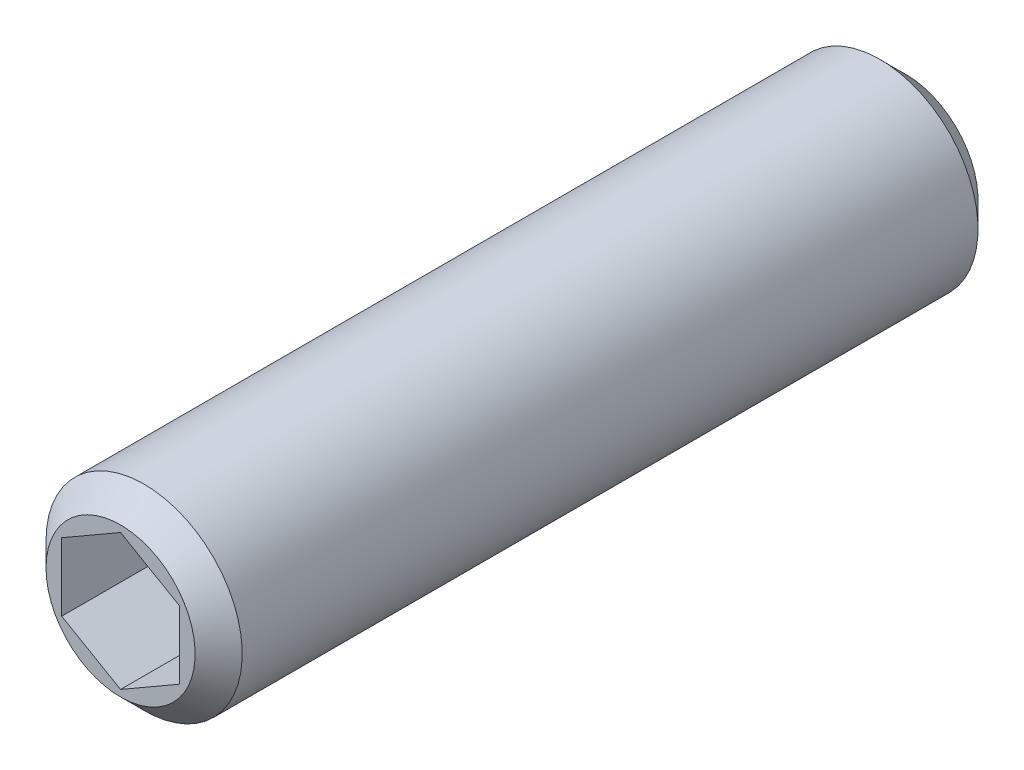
ISO-10303-21;
HEADER;
FILE_DESCRIPTION(('STEP AP214'),'2;1');
FILE_NAME('part.step','',(''),(''),'','','');
FILE_SCHEMA(('AUTOMOTIVE_DESIGN { 1 0 10303 214 1 1 1 1 }'));
ENDSEC;
DATA;
#1=APPLICATION_CONTEXT('core data for automotive mechanical design processes');
#2=APPLICATION_PROTOCOL_DEFINITION('international standard','automotive_design',2000,#1);
#3=PRODUCT_CONTEXT('',#1,'mechanical');
#4=PRODUCT('Part','Part','',(#3));
#5=PRODUCT_RELATED_PRODUCT_CATEGORY('part','',(#4));
#6=PRODUCT_DEFINITION_FORMATION('','',#4);
#7=PRODUCT_DEFINITION_CONTEXT('part definition',#1,'design');
#8=PRODUCT_DEFINITION('design','',#6,#7);
#9=PRODUCT_DEFINITION_SHAPE('','',#8);
#10=(LENGTH_UNIT() NAMED_UNIT(*) SI_UNIT(.MILLI.,.METRE.));
#11=(NAMED_UNIT(*) PLANE_ANGLE_UNIT() SI_UNIT($,.RADIAN.));
#12=(NAMED_UNIT(*) SI_UNIT($,.STERADIAN.) SOLID_ANGLE_UNIT());
#13=UNCERTAINTY_MEASURE_WITH_UNIT(LENGTH_MEASURE(1.E-05),#10,'distance_accuracy_value','');
#14=(GEOMETRIC_REPRESENTATION_CONTEXT(3) GLOBAL_UNCERTAINTY_ASSIGNED_CONTEXT((#13)) GLOBAL_UNIT_ASSIGNED_CONTEXT((#10,
#11,#12)) REPRESENTATION_CONTEXT('',''));
#15=CARTESIAN_POINT('',(0.,0.,0.));
#16=DIRECTION('',(0.,0.,1.));
#17=DIRECTION('',(1.,0.,0.));
#18=AXIS2_PLACEMENT_3D('',#15,#16,#17);
#19=CARTESIAN_POINT('',(-1.43846899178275E-08,0.,8.15));
#20=DIRECTION('',(0.,0.,1.));
#21=DIRECTION('',(0.,-1.,0.));
#22=AXIS2_PLACEMENT_3D('',#19,#20,#21);
#23=CYLINDRICAL_SURFACE('',#22,2.5);
#24=CARTESIAN_POINT('',(-1.43846903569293E-08,0.,20.3000000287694));
#25=DIRECTION('',(0.,0.,-1.));
#26=DIRECTION('',(-1.,0.,0.));
#27=AXIS2_PLACEMENT_3D('',#24,#25,#26);
#28=CIRCLE('',#27,2.5);
#29=CARTESIAN_POINT('',(-2.50000001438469,0.,20.3000000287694));
#30=VERTEX_POINT('',#29);
#31=EDGE_CURVE('E117',#30,#30,#28,.T.);
#32=ORIENTED_EDGE('',*,*,#31,.T.);
#33=EDGE_LOOP('',(#32));
#34=FACE_BOUND('',#33,.T.);
#35=CARTESIAN_POINT('',(0.,0.,1.55));
#36=DIRECTION('',(0.,0.,-1.));
#37=DIRECTION('',(-1.,0.,0.));
#38=AXIS2_PLACEMENT_3D('',#35,#36,#37);
#39=CIRCLE('',#38,2.50000001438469);
#40=CARTESIAN_POINT('',(-2.50000001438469,0.,1.55));
#41=VERTEX_POINT('',#40);
#42=EDGE_CURVE('E90',#41,#41,#39,.T.);
#43=ORIENTED_EDGE('',*,*,#42,.F.);
#44=EDGE_LOOP('',(#43));
#45=FACE_BOUND('',#44,.T.);
#46=ADVANCED_FACE('F14',(#34,#45),#23,.T.);
#47=CARTESIAN_POINT('',(0.,0.,0.9));
#48=DIRECTION('',(0.,0.,1.));
#49=DIRECTION('',(1.,0.,0.));
#50=AXIS2_PLACEMENT_3D('',#47,#48,#49);
#51=CONICAL_SURFACE('',#50,1.85000001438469,0.785398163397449);
#52=ORIENTED_EDGE('',*,*,#42,.T.);
#53=EDGE_LOOP('',(#52));
#54=FACE_BOUND('',#53,.T.);
#55=CARTESIAN_POINT('',(0.,0.,0.9));
#56=DIRECTION('',(0.,0.,-1.));
#57=DIRECTION('',(-1.,0.,0.));
#58=AXIS2_PLACEMENT_3D('',#55,#56,#57);
#59=CIRCLE('',#58,1.85000001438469);
#60=CARTESIAN_POINT('',(-1.85000001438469,0.,0.9));
#61=VERTEX_POINT('',#60);
#62=EDGE_CURVE('E94',#61,#61,#59,.T.);
#63=ORIENTED_EDGE('',*,*,#62,.F.);
#64=EDGE_LOOP('',(#63));
#65=FACE_BOUND('',#64,.T.);
#66=ADVANCED_FACE('F134',(#54,#65),#51,.T.);
#67=CARTESIAN_POINT('',(-1.87220001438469,-1.8722,0.9));
#68=DIRECTION('',(0.,0.,-1.));
#69=DIRECTION('',(0.,1.,0.));
#70=AXIS2_PLACEMENT_3D('',#67,#68,#69);
#71=PLANE('',#70);
#72=CARTESIAN_POINT('',(0.,0.,0.9));
#73=DIRECTION('',(0.,0.,-1.));
#74=DIRECTION('',(-1.,0.,0.));
#75=AXIS2_PLACEMENT_3D('',#72,#73,#74);
#76=CIRCLE('',#75,1.37477270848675);
#77=CARTESIAN_POINT('',(-1.37477270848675,0.,0.9));
#78=VERTEX_POINT('',#77);
#79=EDGE_CURVE('E9',#78,#78,#76,.T.);
#80=ORIENTED_EDGE('',*,*,#79,.F.);
#81=EDGE_LOOP('',(#80));
#82=FACE_BOUND('',#81,.T.);
#83=ORIENTED_EDGE('',*,*,#62,.T.);
#84=EDGE_LOOP('',(#83));
#85=FACE_BOUND('',#84,.T.);
#86=ADVANCED_FACE('F139',(#82,#85),#71,.T.);
#87=CARTESIAN_POINT('',(-1.50000001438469,-1.732050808,17.9));
#88=DIRECTION('',(0.,0.,-1.));
#89=DIRECTION('',(0.,1.,0.));
#90=AXIS2_PLACEMENT_3D('',#87,#88,#89);
#91=PLANE('',#90);
#92=DIRECTION('',(0.866025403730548,0.500000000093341,0.));
#93=VECTOR('',#92,1.);
#94=CARTESIAN_POINT('',(0.74999998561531,-1.299038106,17.9));
#95=LINE('',#94,#93);
#96=CARTESIAN_POINT('',(-1.43846902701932E-08,-1.732050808,17.9));
#97=VERTEX_POINT('',#96);
#98=CARTESIAN_POINT('',(1.49999998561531,-0.866025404,17.9));
#99=VERTEX_POINT('',#98);
#100=EDGE_CURVE('E83',#97,#99,#95,.T.);
#101=ORIENTED_EDGE('',*,*,#100,.T.);
#102=DIRECTION('',(0.,1.,0.));
#103=VECTOR('',#102,1.);
#104=CARTESIAN_POINT('',(1.49999998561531,0.,17.9));
#105=LINE('',#104,#103);
#106=CARTESIAN_POINT('',(1.49999998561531,0.866025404,17.9));
#107=VERTEX_POINT('',#106);
#108=EDGE_CURVE('E110',#99,#107,#105,.T.);
#109=ORIENTED_EDGE('',*,*,#108,.T.);
#110=DIRECTION('',(0.866025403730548,-0.500000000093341,0.));
#111=VECTOR('',#110,1.);
#112=CARTESIAN_POINT('',(-1.43846902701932E-08,1.732050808,17.9));
#113=LINE('',#112,#111);
#114=CARTESIAN_POINT('',(-1.43846902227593E-08,1.732050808,17.9));
#115=VERTEX_POINT('',#114);
#116=EDGE_CURVE('E75',#115,#107,#113,.T.);
#117=ORIENTED_EDGE('',*,*,#116,.F.);
#118=DIRECTION('',(-0.866025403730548,-0.500000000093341,0.));
#119=VECTOR('',#118,1.);
#120=CARTESIAN_POINT('',(-0.75000001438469,1.299038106,17.9));
#121=LINE('',#120,#119);
#122=CARTESIAN_POINT('',(-1.50000001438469,0.866025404,17.9));
#123=VERTEX_POINT('',#122);
#124=EDGE_CURVE('E115',#115,#123,#121,.T.);
#125=ORIENTED_EDGE('',*,*,#124,.T.);
#126=DIRECTION('',(0.,-1.,0.));
#127=VECTOR('',#126,1.);
#128=CARTESIAN_POINT('',(-1.50000001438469,0.,17.9));
#129=LINE('',#128,#127);
#130=CARTESIAN_POINT('',(-1.50000001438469,-0.866025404,17.9));
#131=VERTEX_POINT('',#130);
#132=EDGE_CURVE('E103',#123,#131,#129,.T.);
#133=ORIENTED_EDGE('',*,*,#132,.T.);
#134=DIRECTION('',(-0.866025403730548,0.500000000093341,0.));
#135=VECTOR('',#134,1.);
#136=CARTESIAN_POINT('',(-1.43846902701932E-08,-1.732050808,17.9));
#137=LINE('',#136,#135);
#138=EDGE_CURVE('E97',#97,#131,#137,.T.);
#139=ORIENTED_EDGE('',*,*,#138,.F.);
#140=EDGE_LOOP('',(#101,#109,#117,#125,#133,#139));
#141=FACE_BOUND('',#140,.T.);
#142=ADVANCED_FACE('F149',(#141),#91,.F.);
#143=CARTESIAN_POINT('',(1.49999998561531,-0.866025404,20.9));
#144=DIRECTION('',(0.500000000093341,-0.866025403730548,0.));
#145=DIRECTION('',(-0.866025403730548,-0.500000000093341,0.));
#146=AXIS2_PLACEMENT_3D('',#143,#144,#145);
#147=PLANE('',#146);
#148=DIRECTION('',(0.,0.,1.));
#149=VECTOR('',#148,1.);
#150=CARTESIAN_POINT('',(1.49999998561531,-0.866025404,19.4));
#151=LINE('',#150,#149);
#152=CARTESIAN_POINT('',(1.49999998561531,-0.866025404,20.9));
#153=VERTEX_POINT('',#152);
#154=EDGE_CURVE('E89',#99,#153,#151,.T.);
#155=ORIENTED_EDGE('',*,*,#154,.F.);
#156=ORIENTED_EDGE('',*,*,#100,.F.);
#157=DIRECTION('',(0.,0.,-1.));
#158=VECTOR('',#157,1.);
#159=CARTESIAN_POINT('',(-1.43846903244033E-08,-1.732050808,19.4));
#160=LINE('',#159,#158);
#161=CARTESIAN_POINT('',(-1.43846902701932E-08,-1.732050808,20.9));
#162=VERTEX_POINT('',#161);
#163=EDGE_CURVE('E60',#162,#97,#160,.T.);
#164=ORIENTED_EDGE('',*,*,#163,.F.);
#165=DIRECTION('',(-0.866025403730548,-0.500000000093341,0.));
#166=VECTOR('',#165,1.);
#167=CARTESIAN_POINT('',(1.49999998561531,-0.866025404,20.9));
#168=LINE('',#167,#166);
#169=EDGE_CURVE('E82',#162,#153,#168,.F.);
#170=ORIENTED_EDGE('',*,*,#169,.T.);
#171=EDGE_LOOP('',(#155,#156,#164,#170));
#172=FACE_BOUND('',#171,.T.);
#173=ADVANCED_FACE('F81',(#172),#147,.F.);
#174=CARTESIAN_POINT('',(1.49999998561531,0.866025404,20.9));
#175=DIRECTION('',(1.,0.,0.));
#176=DIRECTION('',(0.,-1.,0.));
#177=AXIS2_PLACEMENT_3D('',#174,#175,#176);
#178=PLANE('',#177);
#179=DIRECTION('',(0.,0.,1.));
#180=VECTOR('',#179,1.);
#181=CARTESIAN_POINT('',(1.49999998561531,0.866025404,19.4));
#182=LINE('',#181,#180);
#183=CARTESIAN_POINT('',(1.49999998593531,0.866025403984,20.9));
#184=VERTEX_POINT('',#183);
#185=EDGE_CURVE('E100',#107,#184,#182,.T.);
#186=ORIENTED_EDGE('',*,*,#185,.F.);
#187=ORIENTED_EDGE('',*,*,#108,.F.);
#188=ORIENTED_EDGE('',*,*,#154,.T.);
#189=DIRECTION('',(0.,-1.,0.));
#190=VECTOR('',#189,1.);
#191=CARTESIAN_POINT('',(1.49999998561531,0.,20.9));
#192=LINE('',#191,#190);
#193=EDGE_CURVE('E84',#184,#153,#192,.T.);
#194=ORIENTED_EDGE('',*,*,#193,.F.);
#195=EDGE_LOOP('',(#186,#187,#188,#194));
#196=FACE_BOUND('',#195,.T.);
#197=ADVANCED_FACE('F160',(#196),#178,.F.);
#198=CARTESIAN_POINT('',(-1.43846903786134E-08,1.732050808,20.9));
#199=DIRECTION('',(0.500000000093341,0.866025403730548,0.));
#200=DIRECTION('',(0.866025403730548,-0.500000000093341,0.));
#201=AXIS2_PLACEMENT_3D('',#198,#199,#200);
#202=PLANE('',#201);
#203=DIRECTION('',(0.,0.,1.));
#204=VECTOR('',#203,1.);
#205=CARTESIAN_POINT('',(-1.43846903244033E-08,1.732050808,19.4));
#206=LINE('',#205,#204);
#207=CARTESIAN_POINT('',(-1.38786902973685E-08,1.73205080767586,20.9));
#208=VERTEX_POINT('',#207);
#209=EDGE_CURVE('E113',#115,#208,#206,.T.);
#210=ORIENTED_EDGE('',*,*,#209,.F.);
#211=ORIENTED_EDGE('',*,*,#116,.T.);
#212=ORIENTED_EDGE('',*,*,#185,.T.);
#213=DIRECTION('',(0.866025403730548,-0.500000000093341,0.));
#214=VECTOR('',#213,1.);
#215=CARTESIAN_POINT('',(0.74999998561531,1.299038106,20.9));
#216=LINE('',#215,#214);
#217=EDGE_CURVE('E49',#208,#184,#216,.T.);
#218=ORIENTED_EDGE('',*,*,#217,.F.);
#219=EDGE_LOOP('',(#210,#211,#212,#218));
#220=FACE_BOUND('',#219,.T.);
#221=ADVANCED_FACE('F157',(#220),#202,.F.);
#222=CARTESIAN_POINT('',(-1.50000001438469,0.866025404,20.9));
#223=DIRECTION('',(-0.500000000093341,0.866025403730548,0.));
#224=DIRECTION('',(0.866025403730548,0.500000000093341,0.));
#225=AXIS2_PLACEMENT_3D('',#222,#223,#224);
#226=PLANE('',#225);
#227=DIRECTION('',(0.,0.,-1.));
#228=VECTOR('',#227,1.);
#229=CARTESIAN_POINT('',(-1.50000001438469,0.866025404,19.4));
#230=LINE('',#229,#228);
#231=CARTESIAN_POINT('',(-1.50000001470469,0.866025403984,20.9));
#232=VERTEX_POINT('',#231);
#233=EDGE_CURVE('E106',#232,#123,#230,.T.);
#234=ORIENTED_EDGE('',*,*,#233,.T.);
#235=ORIENTED_EDGE('',*,*,#124,.F.);
#236=ORIENTED_EDGE('',*,*,#209,.T.);
#237=DIRECTION('',(0.866025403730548,0.500000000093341,0.));
#238=VECTOR('',#237,1.);
#239=CARTESIAN_POINT('',(-0.75000001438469,1.299038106,20.9));
#240=LINE('',#239,#238);
#241=EDGE_CURVE('E31',#232,#208,#240,.T.);
#242=ORIENTED_EDGE('',*,*,#241,.F.);
#243=EDGE_LOOP('',(#234,#235,#236,#242));
#244=FACE_BOUND('',#243,.T.);
#245=ADVANCED_FACE('F156',(#244),#226,.F.);
#246=CARTESIAN_POINT('',(-1.50000001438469,-0.866025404,20.9));
#247=DIRECTION('',(-1.,0.,0.));
#248=DIRECTION('',(0.,1.,0.));
#249=AXIS2_PLACEMENT_3D('',#246,#247,#248);
#250=PLANE('',#249);
#251=DIRECTION('',(0.,0.,-1.));
#252=VECTOR('',#251,1.);
#253=CARTESIAN_POINT('',(-1.50000001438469,-0.866025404,19.4));
#254=LINE('',#253,#252);
#255=CARTESIAN_POINT('',(-1.50000001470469,-0.866025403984,20.9));
#256=VERTEX_POINT('',#255);
#257=EDGE_CURVE('E73',#256,#131,#254,.T.);
#258=ORIENTED_EDGE('',*,*,#257,.T.);
#259=ORIENTED_EDGE('',*,*,#132,.F.);
#260=ORIENTED_EDGE('',*,*,#233,.F.);
#261=DIRECTION('',(0.,1.,0.));
#262=VECTOR('',#261,1.);
#263=CARTESIAN_POINT('',(-1.50000001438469,0.,20.9));
#264=LINE('',#263,#262);
#265=EDGE_CURVE('E107',#256,#232,#264,.T.);
#266=ORIENTED_EDGE('',*,*,#265,.F.);
#267=EDGE_LOOP('',(#258,#259,#260,#266));
#268=FACE_BOUND('',#267,.T.);
#269=ADVANCED_FACE('F155',(#268),#250,.F.);
#270=CARTESIAN_POINT('',(-1.43846903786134E-08,-1.732050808,20.9));
#271=DIRECTION('',(-0.500000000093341,-0.866025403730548,0.));
#272=DIRECTION('',(-0.866025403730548,0.500000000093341,0.));
#273=AXIS2_PLACEMENT_3D('',#270,#271,#272);
#274=PLANE('',#273);
#275=ORIENTED_EDGE('',*,*,#163,.T.);
#276=ORIENTED_EDGE('',*,*,#138,.T.);
#277=ORIENTED_EDGE('',*,*,#257,.F.);
#278=DIRECTION('',(-0.866025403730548,0.500000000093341,0.));
#279=VECTOR('',#278,1.);
#280=CARTESIAN_POINT('',(-0.75000001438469,-1.299038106,20.9));
#281=LINE('',#280,#279);
#282=EDGE_CURVE('E70',#162,#256,#281,.T.);
#283=ORIENTED_EDGE('',*,*,#282,.F.);
#284=EDGE_LOOP('',(#275,#276,#277,#283));
#285=FACE_BOUND('',#284,.T.);
#286=ADVANCED_FACE('F71',(#285),#274,.F.);
#287=CARTESIAN_POINT('',(-2.02400001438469,-2.024,20.9));
#288=DIRECTION('',(0.,0.,-1.));
#289=DIRECTION('',(0.,1.,0.));
#290=AXIS2_PLACEMENT_3D('',#287,#288,#289);
#291=PLANE('',#290);
#292=CARTESIAN_POINT('',(-1.43846903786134E-08,0.,20.9));
#293=DIRECTION('',(0.,0.,-1.));
#294=DIRECTION('',(-1.,0.,0.));
#295=AXIS2_PLACEMENT_3D('',#292,#293,#294);
#296=CIRCLE('',#295,1.90000002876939);
#297=CARTESIAN_POINT('',(-1.90000004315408,0.,20.9));
#298=VERTEX_POINT('',#297);
#299=EDGE_CURVE('E23',#298,#298,#296,.F.);
#300=ORIENTED_EDGE('',*,*,#299,.T.);
#301=EDGE_LOOP('',(#300));
#302=FACE_BOUND('',#301,.T.);
#303=ORIENTED_EDGE('',*,*,#282,.T.);
#304=ORIENTED_EDGE('',*,*,#265,.T.);
#305=ORIENTED_EDGE('',*,*,#241,.T.);
#306=ORIENTED_EDGE('',*,*,#217,.T.);
#307=ORIENTED_EDGE('',*,*,#193,.T.);
#308=ORIENTED_EDGE('',*,*,#169,.F.);
#309=EDGE_LOOP('',(#303,#304,#305,#306,#307,#308));
#310=FACE_BOUND('',#309,.T.);
#311=ADVANCED_FACE('F86',(#302,#310),#291,.F.);
#312=CARTESIAN_POINT('',(-1.43846903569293E-08,0.,20.3000000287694));
#313=DIRECTION('',(0.,0.,-1.));
#314=DIRECTION('',(-1.,0.,0.));
#315=AXIS2_PLACEMENT_3D('',#312,#313,#314);
#316=CONICAL_SURFACE('',#315,2.5,0.785398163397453);
#317=ORIENTED_EDGE('',*,*,#299,.F.);
#318=EDGE_LOOP('',(#317));
#319=FACE_BOUND('',#318,.T.);
#320=ORIENTED_EDGE('',*,*,#31,.F.);
#321=EDGE_LOOP('',(#320));
#322=FACE_BOUND('',#321,.T.);
#323=ADVANCED_FACE('F16',(#319,#322),#316,.T.);
#324=CARTESIAN_POINT('',(0.,0.,1.5));
#325=DIRECTION('',(0.,0.,-1.));
#326=DIRECTION('',(-1.,0.,0.));
#327=AXIS2_PLACEMENT_3D('',#324,#325,#326);
#328=SPHERICAL_SURFACE('',#327,1.5);
#329=ORIENTED_EDGE('',*,*,#79,.T.);
#330=EDGE_LOOP('',(#329));
#331=FACE_BOUND('',#330,.T.);
#332=ADVANCED_FACE('F129',(#331),#328,.T.);
#333=CLOSED_SHELL('',(#46,#66,#86,#142,#173,#197,#221,#245,#269,#286,#311,#323,#332));
#334=MANIFOLD_SOLID_BREP('B1',#333);
#335=ADVANCED_BREP_SHAPE_REPRESENTATION('',(#18,#334),#14);
#336=SHAPE_DEFINITION_REPRESENTATION(#9,#335);
ENDSEC;
END-ISO-10303-21;
